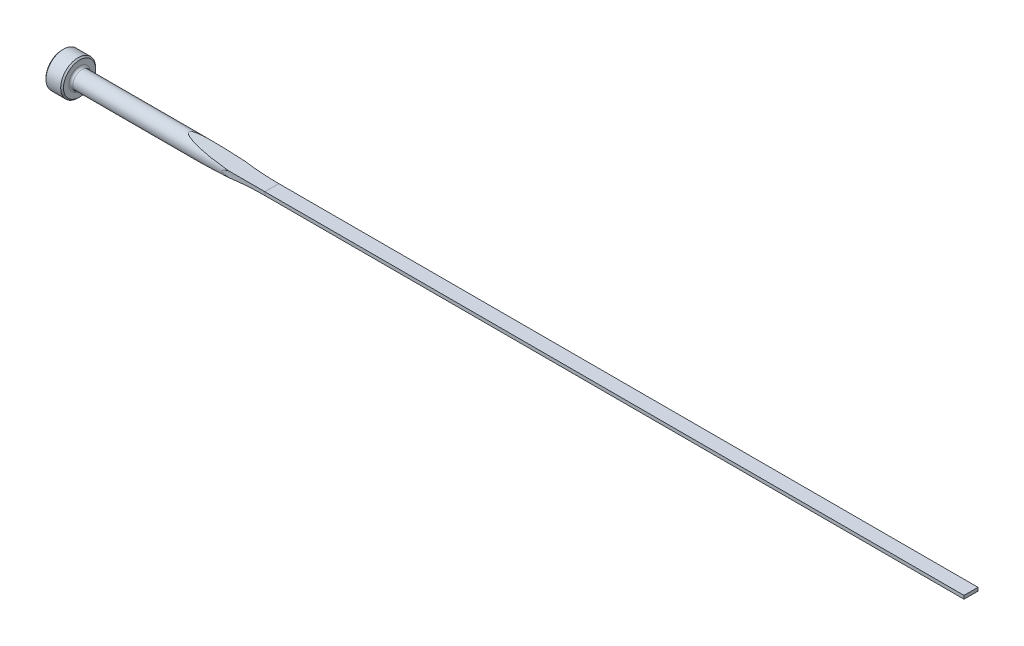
from build123d import *

# Parameters (mm, degrees)
CUT_EXTRUDE1_DEPTH = 166.161046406
CUT_EXTRUDE2_DEPTH = 166.161046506
FILLET1_R          = 0.381
CHAMFER1_SIZE      = 0.254


with BuildPart() as part:
    # Sketch1 → Revolve1 (revolve)
    with BuildSketch(Plane.XY, mode=Mode.PRIVATE) as revolve1_sk:
        Polygon((0, 0), (0, 3.175), (3.175, 3.175), (3.175, 1.5875), (165.1, 1.5875), (165.1, 0), align=None)
    revolve(revolve1_sk.sketch.rotate(Axis((0, 0, 0), (1, 0, 0)), 90), axis=Axis((0, 0, 0), (1, 0, 0)))

    # Sketch2 → Cut-Extrude1 (cut, symmetric)
    with BuildSketch(Plane.XY):
        with BuildLine():
            Line((165.1, 1.5875), (165.1, 0.3048))
            Line((165.1, 0.3048), (38.1, 0.3048))
            ThreePointArc((38.1, 0.3048), (30.54910502, 0.626055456), (23.052782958, 1.5875))
            Line((23.052782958, 1.5875), (165.1, 1.5875))
        make_face()
    cut_extrude1 = extrude(amount=CUT_EXTRUDE1_DEPTH, both=True, mode=Mode.SUBTRACT)

    # Mirror1: Cut-Extrude1 across plane
    add(cut_extrude1.mirror(Plane.ZX), mode=Mode.SUBTRACT)

    # Sketch3 → Cut-Extrude2 (cut, symmetric)
    with BuildSketch(Plane(origin=(0, 0, 0), x_dir=(1, 0, 0), z_dir=(0, 1, 0))):
        with BuildLine():
            Line((165.1, 1.5875), (165.1, 1.27))
            Line((165.1, 1.27), (38.1, 1.27))
            ThreePointArc((38.1, 1.27), (34.343289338, 1.349410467), (30.593290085, 1.5875))
            Line((30.593290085, 1.5875), (165.1, 1.5875))
        make_face()
    cut_extrude2 = extrude(amount=CUT_EXTRUDE2_DEPTH, both=True, mode=Mode.SUBTRACT)

    # Mirror2: Cut-Extrude2 across plane
    add(cut_extrude2.mirror(Plane.XY), mode=Mode.SUBTRACT)

    # Fillet1
    fillet1_edges = [part.edges().sort_by_distance(p)[0] for p in [
        (3.175, 0, -1.5875),
    ]]
    fillet(fillet1_edges, radius=FILLET1_R)

    # Chamfer1
    chamfer1_edges = [part.edges().sort_by_distance(p)[0] for p in [
        (3.175, 0, -3.175),
        (0, 0, -3.175),
    ]]
    chamfer(chamfer1_edges, length=CHAMFER1_SIZE)


solid = part.part
